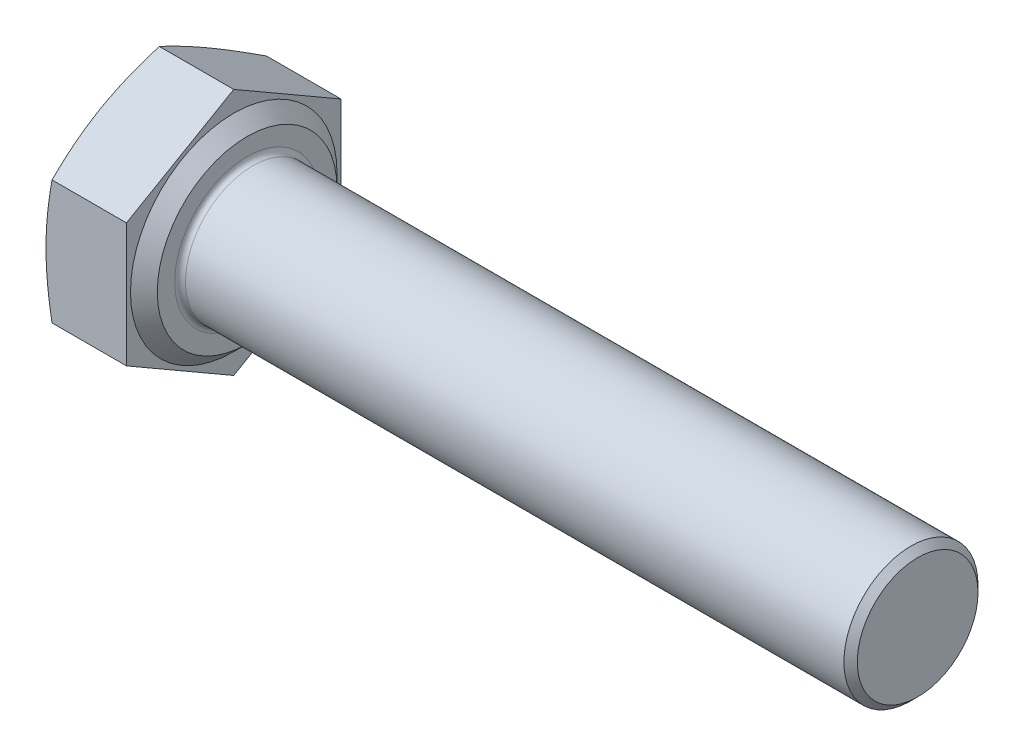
from build123d import *

# Parameters (mm, degrees)
BASEHEAD_DEPTH = 3.5
SKETCH5_R      = 2.5
BASEBODY_DEPTH = 25
CHAMFER1_SIZE  = 0.25
HEADFILLET_R   = 0.2


with BuildPart() as part:
    # Sketch2 → BaseHead (new body)
    with BuildSketch(Plane(origin=(0, 0, 0), x_dir=(0, 0, -1), z_dir=(1, 0, 0))):
        Polygon((0, -4.618802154), (4, -2.309401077), (4, 2.309401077), (0, 4.618802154), (-4, 2.309401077), (-4, -2.309401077), align=None)
    extrude(amount=BASEHEAD_DEPTH)

    # Sketch3 → BearingFace (revolve, cut)
    with BuildSketch(Plane.XY, mode=Mode.PRIVATE) as bearingface_sk:
        Polygon((3.5, 4.618802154), (3.5, 3.35), (3, 3.85), (3, 4.618802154), align=None)
    revolve(bearingface_sk.sketch.rotate(Axis((-0.957090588, 0, 0), (1, 0, 0)), 90), axis=Axis((-0.957090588, 0, 0), (1, 0, 0)), mode=Mode.SUBTRACT)

    # Sketch4 → HeadChamfer (revolve, cut)
    with BuildSketch(Plane.XY):
        Polygon((0, 4.618802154), (0.225225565, 4.618802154), (0, 4), align=None)
    revolve(axis=Axis((-0.493528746, 0, 0), (1, 0, 0)), mode=Mode.SUBTRACT)

    # Sketch5 → BaseBody (add)
    with BuildSketch(Plane(origin=(3.5, 0, 0), x_dir=(0, 0, -1), z_dir=(1, 0, 0))):
        Circle(SKETCH5_R)
    extrude(amount=BASEBODY_DEPTH)

    # Chamfer1
    chamfer1_edges = [part.edges().sort_by_distance(p)[0] for p in [
        (28.5, 0, 2.5),
    ]]
    chamfer(chamfer1_edges, length=CHAMFER1_SIZE)

    # HeadFillet
    headfillet_edges = [part.edges().sort_by_distance(p)[0] for p in [
        (3.5, 0, 2.5),
    ]]
    fillet(headfillet_edges, radius=HEADFILLET_R)


solid = part.part
